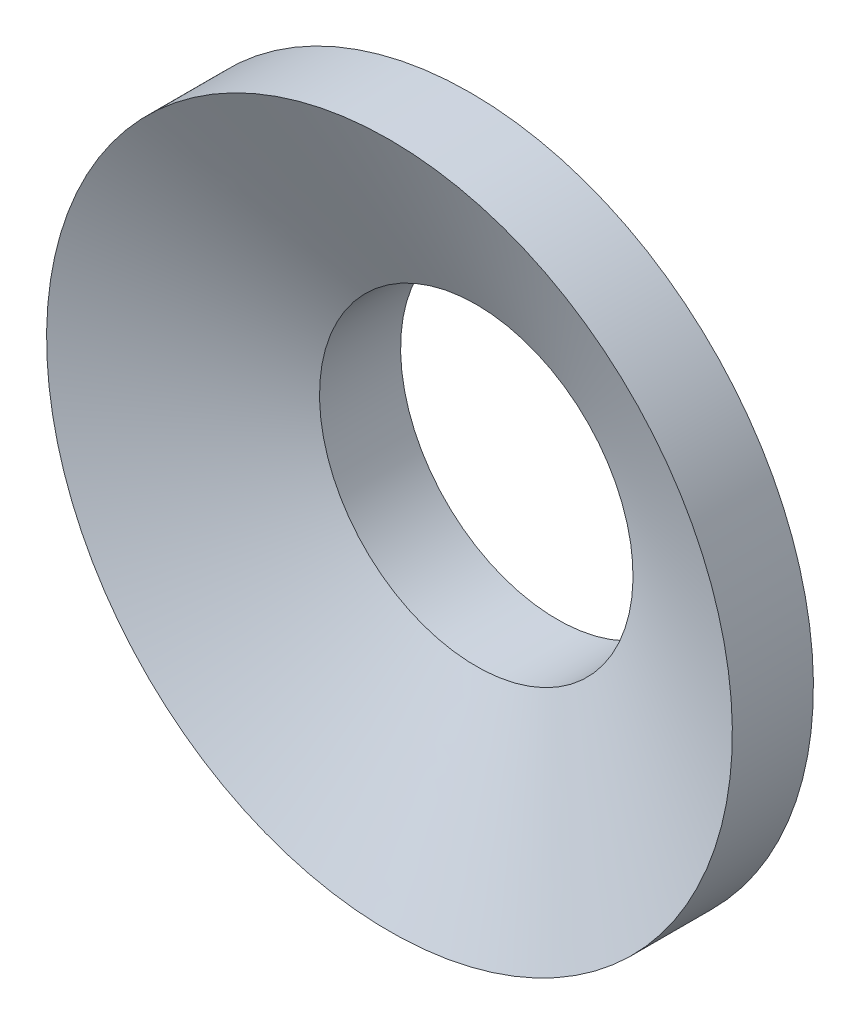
ISO-10303-21;
HEADER;
FILE_DESCRIPTION(('STEP AP214'),'2;1');
FILE_NAME('part.step','',(''),(''),'','','');
FILE_SCHEMA(('AUTOMOTIVE_DESIGN { 1 0 10303 214 1 1 1 1 }'));
ENDSEC;
DATA;
#1=APPLICATION_CONTEXT('core data for automotive mechanical design processes');
#2=APPLICATION_PROTOCOL_DEFINITION('international standard','automotive_design',2000,#1);
#3=PRODUCT_CONTEXT('',#1,'mechanical');
#4=PRODUCT('Part','Part','',(#3));
#5=PRODUCT_RELATED_PRODUCT_CATEGORY('part','',(#4));
#6=PRODUCT_DEFINITION_FORMATION('','',#4);
#7=PRODUCT_DEFINITION_CONTEXT('part definition',#1,'design');
#8=PRODUCT_DEFINITION('design','',#6,#7);
#9=PRODUCT_DEFINITION_SHAPE('','',#8);
#10=(LENGTH_UNIT() NAMED_UNIT(*) SI_UNIT(.MILLI.,.METRE.));
#11=(NAMED_UNIT(*) PLANE_ANGLE_UNIT() SI_UNIT($,.RADIAN.));
#12=(NAMED_UNIT(*) SI_UNIT($,.STERADIAN.) SOLID_ANGLE_UNIT());
#13=UNCERTAINTY_MEASURE_WITH_UNIT(LENGTH_MEASURE(1.E-05),#10,'distance_accuracy_value','');
#14=(GEOMETRIC_REPRESENTATION_CONTEXT(3) GLOBAL_UNCERTAINTY_ASSIGNED_CONTEXT((#13)) GLOBAL_UNIT_ASSIGNED_CONTEXT((#10,
#11,#12)) REPRESENTATION_CONTEXT('',''));
#15=CARTESIAN_POINT('',(0.,0.,0.));
#16=DIRECTION('',(0.,0.,1.));
#17=DIRECTION('',(1.,0.,0.));
#18=AXIS2_PLACEMENT_3D('',#15,#16,#17);
#19=DIRECTION('',(0.,0.906307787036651,0.422618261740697));
#20=VECTOR('',#19,1.);
#21=CARTESIAN_POINT('',(-1.22215714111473E-10,499000.,232687.684301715));
#22=LINE('',#21,#20);
#23=CARTESIAN_POINT('',(0.,0.,0.162882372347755));
#24=DIRECTION('',(0.,0.,1.));
#25=AXIS1_PLACEMENT('',#23,#24);
#26=SURFACE_OF_REVOLUTION('',#22,#25);
#27=CARTESIAN_POINT('',(0.,0.,1.65506687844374));
#28=DIRECTION('',(0.,0.,1.));
#29=DIRECTION('',(0.,1.,0.));
#30=AXIS2_PLACEMENT_3D('',#27,#28,#29);
#31=CIRCLE('',#30,3.2);
#32=CARTESIAN_POINT('',(0.,3.2,1.65506687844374));
#33=VERTEX_POINT('',#32);
#34=EDGE_CURVE('E23',#33,#33,#31,.T.);
#35=ORIENTED_EDGE('',*,*,#34,.F.);
#36=EDGE_LOOP('',(#35));
#37=FACE_BOUND('',#36,.T.);
#38=CARTESIAN_POINT('',(0.,0.,3.42703597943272));
#39=DIRECTION('',(0.,0.,1.));
#40=DIRECTION('',(0.,1.,0.));
#41=AXIS2_PLACEMENT_3D('',#38,#39,#40);
#42=CIRCLE('',#41,7.);
#43=CARTESIAN_POINT('',(0.,7.,3.42703597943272));
#44=VERTEX_POINT('',#43);
#45=EDGE_CURVE('E31',#44,#44,#42,.T.);
#46=ORIENTED_EDGE('',*,*,#45,.T.);
#47=EDGE_LOOP('',(#46));
#48=FACE_BOUND('',#47,.T.);
#49=ADVANCED_FACE('F15',(#37,#48),#26,.F.);
#50=CARTESIAN_POINT('',(0.,0.,2.59950254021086));
#51=DIRECTION('',(0.,0.,1.));
#52=DIRECTION('',(1.,0.,0.));
#53=AXIS2_PLACEMENT_3D('',#50,#51,#52);
#54=CYLINDRICAL_SURFACE('',#53,7.);
#55=CARTESIAN_POINT('',(0.,0.,1.77196910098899));
#56=DIRECTION('',(0.,0.,1.));
#57=DIRECTION('',(0.,1.,0.));
#58=AXIS2_PLACEMENT_3D('',#55,#56,#57);
#59=CIRCLE('',#58,7.);
#60=CARTESIAN_POINT('',(0.,7.,1.77196910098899));
#61=VERTEX_POINT('',#60);
#62=EDGE_CURVE('E28',#61,#61,#59,.T.);
#63=ORIENTED_EDGE('',*,*,#62,.T.);
#64=EDGE_LOOP('',(#63));
#65=FACE_BOUND('',#64,.T.);
#66=ORIENTED_EDGE('',*,*,#45,.F.);
#67=EDGE_LOOP('',(#66));
#68=FACE_BOUND('',#67,.T.);
#69=ADVANCED_FACE('F41',(#65,#68),#54,.T.);
#70=DIRECTION('',(0.,-0.90630778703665,-0.422618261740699));
#71=VECTOR('',#70,1.);
#72=CARTESIAN_POINT('',(-1.22215714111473E-10,499000.,232686.029234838));
#73=LINE('',#72,#71);
#74=CARTESIAN_POINT('',(0.,0.,-1.49218450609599));
#75=DIRECTION('',(0.,0.,1.));
#76=AXIS1_PLACEMENT('',#74,#75);
#77=SURFACE_OF_REVOLUTION('',#73,#76);
#78=CARTESIAN_POINT('',(0.,0.,0.));
#79=DIRECTION('',(0.,0.,1.));
#80=DIRECTION('',(0.,1.,0.));
#81=AXIS2_PLACEMENT_3D('',#78,#79,#80);
#82=CIRCLE('',#81,3.2);
#83=CARTESIAN_POINT('',(0.,3.2,0.));
#84=VERTEX_POINT('',#83);
#85=EDGE_CURVE('E10',#84,#84,#82,.T.);
#86=ORIENTED_EDGE('',*,*,#85,.T.);
#87=EDGE_LOOP('',(#86));
#88=FACE_BOUND('',#87,.T.);
#89=ORIENTED_EDGE('',*,*,#62,.F.);
#90=EDGE_LOOP('',(#89));
#91=FACE_BOUND('',#90,.T.);
#92=ADVANCED_FACE('F44',(#88,#91),#77,.F.);
#93=CARTESIAN_POINT('',(0.,0.,0.82753343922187));
#94=DIRECTION('',(0.,0.,-1.));
#95=DIRECTION('',(0.,1.,0.));
#96=AXIS2_PLACEMENT_3D('',#93,#94,#95);
#97=CIRCLE('',#96,3.2);
#98=DIRECTION('',(0.,0.,1.));
#99=VECTOR('',#98,1.);
#100=SURFACE_OF_LINEAR_EXTRUSION('',#97,#99);
#101=ORIENTED_EDGE('',*,*,#85,.F.);
#102=EDGE_LOOP('',(#101));
#103=FACE_BOUND('',#102,.T.);
#104=ORIENTED_EDGE('',*,*,#34,.T.);
#105=EDGE_LOOP('',(#104));
#106=FACE_BOUND('',#105,.T.);
#107=ADVANCED_FACE('F17',(#103,#106),#100,.T.);
#108=CLOSED_SHELL('',(#49,#69,#92,#107));
#109=MANIFOLD_SOLID_BREP('B1',#108);
#110=ADVANCED_BREP_SHAPE_REPRESENTATION('',(#18,#109),#14);
#111=SHAPE_DEFINITION_REPRESENTATION(#9,#110);
ENDSEC;
END-ISO-10303-21;
